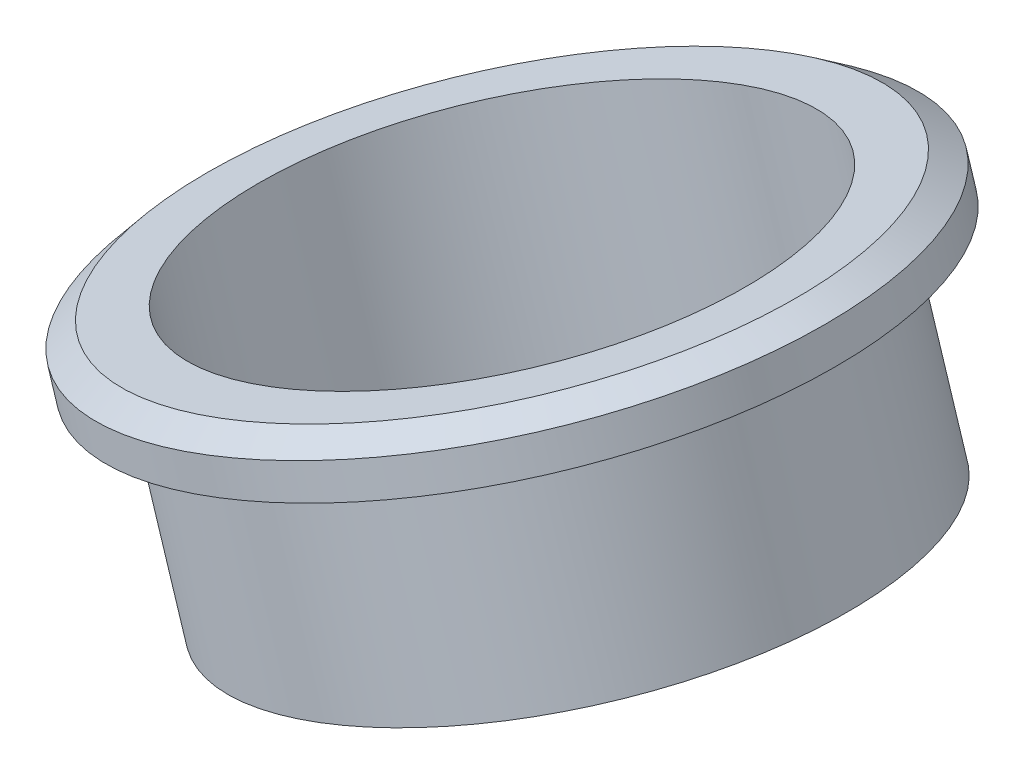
from build123d import *


with BuildPart() as part:
    # Sk_Cono → Cono (revolve)
    with BuildSketch(Plane.XY, mode=Mode.PRIVATE) as cono_sk:
        Polygon((385.500399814, 520.056357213), (387.121714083, 520.567571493), (383.513142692, 532.012142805), (386.37428552, 532.914285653), (385.772856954, 534.821714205), (384.041571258, 535.324357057), (380.989685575, 534.362071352), align=None)
    revolve(cono_sk.sketch.rotate(Axis((364.894285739, 534.529714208, 0), (0.3007142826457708, -0.9537142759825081, 0)), 180), axis=Axis((364.894285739, 534.529714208, 0), (0.3007142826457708, -0.9537142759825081, 0)))


solid = part.part
